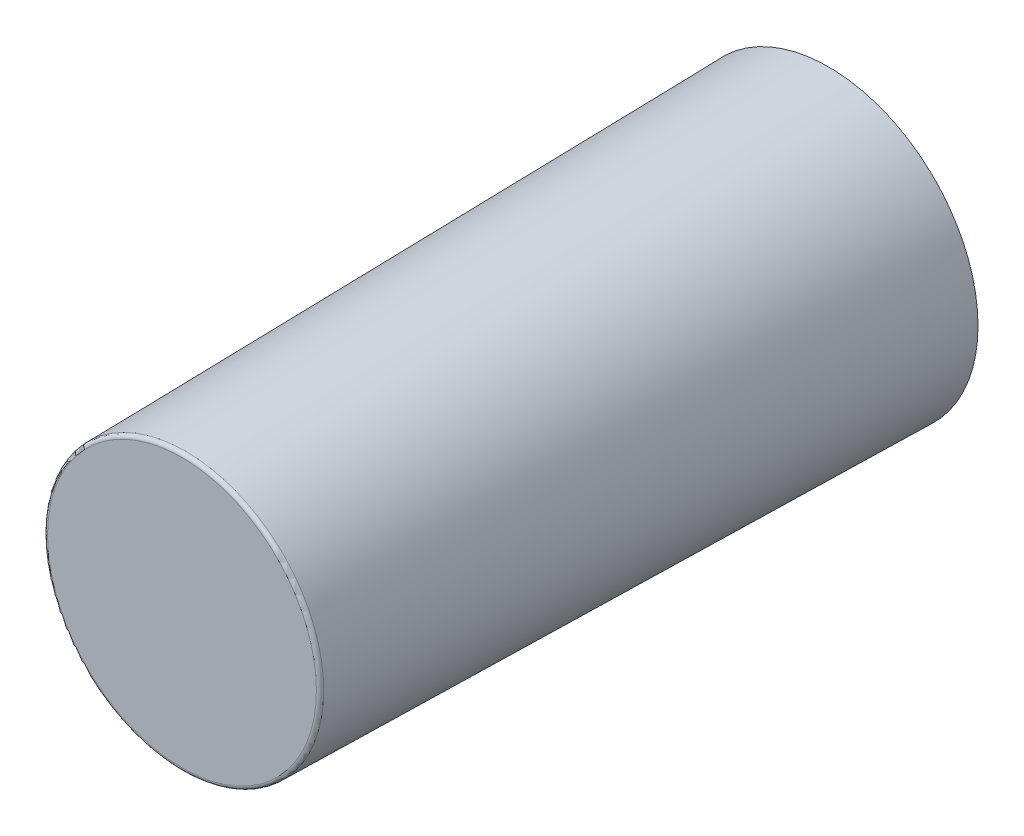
ISO-10303-21;
HEADER;
FILE_DESCRIPTION(('STEP AP214'),'2;1');
FILE_NAME('part.step','',(''),(''),'','','');
FILE_SCHEMA(('AUTOMOTIVE_DESIGN { 1 0 10303 214 1 1 1 1 }'));
ENDSEC;
DATA;
#1=APPLICATION_CONTEXT('core data for automotive mechanical design processes');
#2=APPLICATION_PROTOCOL_DEFINITION('international standard','automotive_design',2000,#1);
#3=PRODUCT_CONTEXT('',#1,'mechanical');
#4=PRODUCT('Part','Part','',(#3));
#5=PRODUCT_RELATED_PRODUCT_CATEGORY('part','',(#4));
#6=PRODUCT_DEFINITION_FORMATION('','',#4);
#7=PRODUCT_DEFINITION_CONTEXT('part definition',#1,'design');
#8=PRODUCT_DEFINITION('design','',#6,#7);
#9=PRODUCT_DEFINITION_SHAPE('','',#8);
#10=(LENGTH_UNIT() NAMED_UNIT(*) SI_UNIT(.MILLI.,.METRE.));
#11=(NAMED_UNIT(*) PLANE_ANGLE_UNIT() SI_UNIT($,.RADIAN.));
#12=(NAMED_UNIT(*) SI_UNIT($,.STERADIAN.) SOLID_ANGLE_UNIT());
#13=UNCERTAINTY_MEASURE_WITH_UNIT(LENGTH_MEASURE(1.E-05),#10,'distance_accuracy_value','');
#14=(GEOMETRIC_REPRESENTATION_CONTEXT(3) GLOBAL_UNCERTAINTY_ASSIGNED_CONTEXT((#13)) GLOBAL_UNIT_ASSIGNED_CONTEXT((#10,
#11,#12)) REPRESENTATION_CONTEXT('',''));
#15=CARTESIAN_POINT('',(0.,0.,0.));
#16=DIRECTION('',(0.,0.,1.));
#17=DIRECTION('',(1.,0.,0.));
#18=AXIS2_PLACEMENT_3D('',#15,#16,#17);
#19=CARTESIAN_POINT('',(0.,0.,27.4574));
#20=DIRECTION('',(0.,0.,-1.));
#21=DIRECTION('',(1.,0.,0.));
#22=AXIS2_PLACEMENT_3D('',#19,#20,#21);
#23=CONICAL_SURFACE('',#22,20.193,0.0174532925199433);
#24=CARTESIAN_POINT('',(0.,0.,114.405626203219));
#25=DIRECTION('',(0.,0.,-1.));
#26=DIRECTION('',(-1.,0.,0.));
#27=AXIS2_PLACEMENT_3D('',#24,#25,#26);
#28=CIRCLE('',#27,18.6753130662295);
#29=CARTESIAN_POINT('',(-18.6753130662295,0.,114.405626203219));
#30=VERTEX_POINT('',#29);
#31=EDGE_CURVE('E10',#30,#30,#28,.T.);
#32=ORIENTED_EDGE('',*,*,#31,.T.);
#33=EDGE_LOOP('',(#32));
#34=FACE_BOUND('',#33,.T.);
#35=CARTESIAN_POINT('',(0.,0.,27.4574));
#36=DIRECTION('',(0.,0.,1.));
#37=DIRECTION('',(1.,0.,0.));
#38=AXIS2_PLACEMENT_3D('',#35,#36,#37);
#39=CIRCLE('',#38,20.193);
#40=CARTESIAN_POINT('',(20.193,0.,27.4574));
#41=VERTEX_POINT('',#40);
#42=EDGE_CURVE('E50',#41,#41,#39,.T.);
#43=ORIENTED_EDGE('',*,*,#42,.T.);
#44=EDGE_LOOP('',(#43));
#45=FACE_BOUND('',#44,.T.);
#46=ADVANCED_FACE('F39',(#34,#45),#23,.T.);
#47=CARTESIAN_POINT('',(0.,0.,114.8969));
#48=DIRECTION('',(0.,0.,1.));
#49=DIRECTION('',(1.,0.,0.));
#50=AXIS2_PLACEMENT_3D('',#47,#48,#49);
#51=PLANE('',#50);
#52=CARTESIAN_POINT('',(0.,0.,114.8969));
#53=DIRECTION('',(0.,0.,1.));
#54=DIRECTION('',(1.,0.,0.));
#55=AXIS2_PLACEMENT_3D('',#52,#53,#54);
#56=CIRCLE('',#55,18.1753892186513);
#57=CARTESIAN_POINT('',(18.1753892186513,0.,114.8969));
#58=VERTEX_POINT('',#57);
#59=EDGE_CURVE('E46',#58,#58,#56,.T.);
#60=ORIENTED_EDGE('',*,*,#59,.T.);
#61=EDGE_LOOP('',(#60));
#62=FACE_BOUND('',#61,.T.);
#63=ADVANCED_FACE('F60',(#62),#51,.T.);
#64=CARTESIAN_POINT('',(0.,0.,27.4574));
#65=DIRECTION('',(0.,0.,1.));
#66=DIRECTION('',(1.,0.,0.));
#67=AXIS2_PLACEMENT_3D('',#64,#65,#66);
#68=PLANE('',#67);
#69=ORIENTED_EDGE('',*,*,#42,.F.);
#70=EDGE_LOOP('',(#69));
#71=FACE_BOUND('',#70,.T.);
#72=ADVANCED_FACE('F58',(#71),#68,.F.);
#73=CARTESIAN_POINT('',(0.,0.,114.3969));
#74=DIRECTION('',(0.,0.,1.));
#75=DIRECTION('',(1.,0.,0.));
#76=AXIS2_PLACEMENT_3D('',#73,#74,#75);
#77=TOROIDAL_SURFACE('',#76,18.1753892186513,0.5);
#78=ORIENTED_EDGE('',*,*,#31,.F.);
#79=EDGE_LOOP('',(#78));
#80=FACE_BOUND('',#79,.T.);
#81=ORIENTED_EDGE('',*,*,#59,.F.);
#82=EDGE_LOOP('',(#81));
#83=FACE_BOUND('',#82,.T.);
#84=ADVANCED_FACE('F41',(#80,#83),#77,.T.);
#85=CLOSED_SHELL('',(#46,#63,#72,#84));
#86=MANIFOLD_SOLID_BREP('B2',#85);
#87=ADVANCED_BREP_SHAPE_REPRESENTATION('',(#18,#86),#14);
#88=SHAPE_DEFINITION_REPRESENTATION(#9,#87);
ENDSEC;
END-ISO-10303-21;
